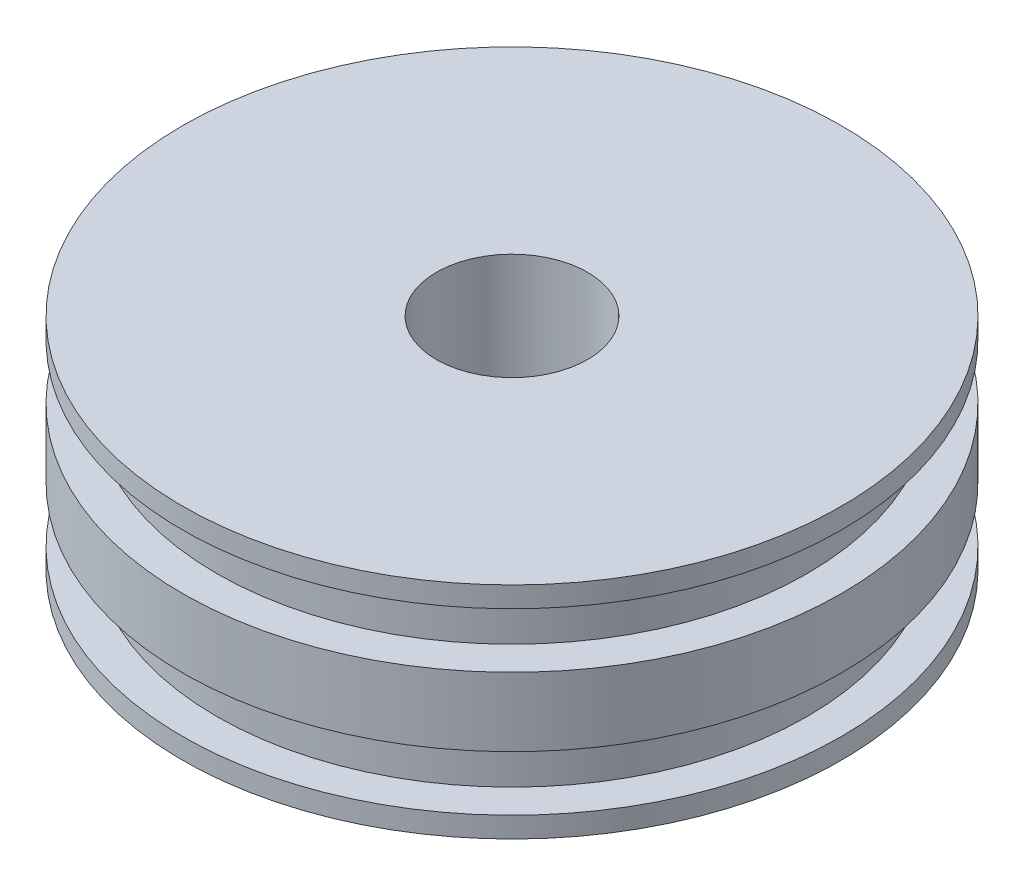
ISO-10303-21;
HEADER;
FILE_DESCRIPTION(('STEP AP214'),'2;1');
FILE_NAME('part.step','',(''),(''),'','','');
FILE_SCHEMA(('AUTOMOTIVE_DESIGN { 1 0 10303 214 1 1 1 1 }'));
ENDSEC;
DATA;
#1=APPLICATION_CONTEXT('core data for automotive mechanical design processes');
#2=APPLICATION_PROTOCOL_DEFINITION('international standard','automotive_design',2000,#1);
#3=PRODUCT_CONTEXT('',#1,'mechanical');
#4=PRODUCT('Part','Part','',(#3));
#5=PRODUCT_RELATED_PRODUCT_CATEGORY('part','',(#4));
#6=PRODUCT_DEFINITION_FORMATION('','',#4);
#7=PRODUCT_DEFINITION_CONTEXT('part definition',#1,'design');
#8=PRODUCT_DEFINITION('design','',#6,#7);
#9=PRODUCT_DEFINITION_SHAPE('','',#8);
#10=(LENGTH_UNIT() NAMED_UNIT(*) SI_UNIT(.MILLI.,.METRE.));
#11=(NAMED_UNIT(*) PLANE_ANGLE_UNIT() SI_UNIT($,.RADIAN.));
#12=(NAMED_UNIT(*) SI_UNIT($,.STERADIAN.) SOLID_ANGLE_UNIT());
#13=UNCERTAINTY_MEASURE_WITH_UNIT(LENGTH_MEASURE(1.E-05),#10,'distance_accuracy_value','');
#14=(GEOMETRIC_REPRESENTATION_CONTEXT(3) GLOBAL_UNCERTAINTY_ASSIGNED_CONTEXT((#13)) GLOBAL_UNIT_ASSIGNED_CONTEXT((#10,
#11,#12)) REPRESENTATION_CONTEXT('',''));
#15=CARTESIAN_POINT('',(0.,0.,0.));
#16=DIRECTION('',(0.,0.,1.));
#17=DIRECTION('',(1.,0.,0.));
#18=AXIS2_PLACEMENT_3D('',#15,#16,#17);
#19=CARTESIAN_POINT('',(0.,0.,0.));
#20=DIRECTION('',(0.,1.,0.));
#21=DIRECTION('',(-1.,0.,0.));
#22=AXIS2_PLACEMENT_3D('',#19,#20,#21);
#23=CYLINDRICAL_SURFACE('',#22,38.0365);
#24=CARTESIAN_POINT('',(0.,16.66875,0.));
#25=DIRECTION('',(0.,-1.,0.));
#26=DIRECTION('',(1.,0.,0.));
#27=AXIS2_PLACEMENT_3D('',#24,#25,#26);
#28=CIRCLE('',#27,38.0365);
#29=CARTESIAN_POINT('',(38.0365,16.66875,0.));
#30=VERTEX_POINT('',#29);
#31=EDGE_CURVE('E60',#30,#30,#28,.T.);
#32=ORIENTED_EDGE('',*,*,#31,.T.);
#33=EDGE_LOOP('',(#32));
#34=FACE_BOUND('',#33,.T.);
#35=CARTESIAN_POINT('',(0.,8.73124999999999,0.));
#36=DIRECTION('',(0.,-1.,0.));
#37=DIRECTION('',(1.,0.,0.));
#38=AXIS2_PLACEMENT_3D('',#35,#36,#37);
#39=CIRCLE('',#38,38.0365);
#40=CARTESIAN_POINT('',(38.0365,8.73124999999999,0.));
#41=VERTEX_POINT('',#40);
#42=EDGE_CURVE('E57',#41,#41,#39,.T.);
#43=ORIENTED_EDGE('',*,*,#42,.F.);
#44=EDGE_LOOP('',(#43));
#45=FACE_BOUND('',#44,.T.);
#46=ADVANCED_FACE('F28',(#34,#45),#23,.T.);
#47=CARTESIAN_POINT('',(0.,2.38124999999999,0.));
#48=DIRECTION('',(0.,-1.,0.));
#49=DIRECTION('',(1.,0.,0.));
#50=AXIS2_PLACEMENT_3D('',#47,#48,#49);
#51=CIRCLE('',#50,38.0365);
#52=CARTESIAN_POINT('',(38.0365,2.38124999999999,0.));
#53=VERTEX_POINT('',#52);
#54=EDGE_CURVE('E48',#53,#53,#51,.T.);
#55=ORIENTED_EDGE('',*,*,#54,.T.);
#56=EDGE_LOOP('',(#55));
#57=FACE_BOUND('',#56,.T.);
#58=CARTESIAN_POINT('',(0.,0.,0.));
#59=DIRECTION('',(0.,1.,0.));
#60=DIRECTION('',(-1.,0.,0.));
#61=AXIS2_PLACEMENT_3D('',#58,#59,#60);
#62=CIRCLE('',#61,38.0365);
#63=CARTESIAN_POINT('',(-38.0365,0.,0.));
#64=VERTEX_POINT('',#63);
#65=EDGE_CURVE('E10',#64,#64,#62,.T.);
#66=ORIENTED_EDGE('',*,*,#65,.T.);
#67=EDGE_LOOP('',(#66));
#68=FACE_BOUND('',#67,.T.);
#69=ADVANCED_FACE('F79',(#57,#68),#23,.T.);
#70=CARTESIAN_POINT('',(38.0365,25.4,0.));
#71=DIRECTION('',(0.,-1.,0.));
#72=DIRECTION('',(1.,0.,0.));
#73=AXIS2_PLACEMENT_3D('',#70,#71,#72);
#74=PLANE('',#73);
#75=CARTESIAN_POINT('',(0.,25.4,0.));
#76=DIRECTION('',(0.,1.,0.));
#77=DIRECTION('',(-1.,0.,0.));
#78=AXIS2_PLACEMENT_3D('',#75,#76,#77);
#79=CIRCLE('',#78,38.0365);
#80=CARTESIAN_POINT('',(-38.0365,25.4,0.));
#81=VERTEX_POINT('',#80);
#82=EDGE_CURVE('E35',#81,#81,#79,.T.);
#83=ORIENTED_EDGE('',*,*,#82,.T.);
#84=EDGE_LOOP('',(#83));
#85=FACE_BOUND('',#84,.T.);
#86=CARTESIAN_POINT('',(0.,25.4,0.));
#87=DIRECTION('',(0.,1.,0.));
#88=DIRECTION('',(0.,0.,1.));
#89=AXIS2_PLACEMENT_3D('',#86,#87,#88);
#90=CIRCLE('',#89,8.73124999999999);
#91=CARTESIAN_POINT('',(0.,25.4,8.73124999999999));
#92=VERTEX_POINT('',#91);
#93=EDGE_CURVE('E43',#92,#92,#90,.T.);
#94=ORIENTED_EDGE('',*,*,#93,.F.);
#95=EDGE_LOOP('',(#94));
#96=FACE_BOUND('',#95,.T.);
#97=ADVANCED_FACE('F87',(#85,#96),#74,.F.);
#98=CARTESIAN_POINT('',(0.,0.,0.));
#99=DIRECTION('',(0.,1.,0.));
#100=DIRECTION('',(-1.,0.,0.));
#101=AXIS2_PLACEMENT_3D('',#98,#99,#100);
#102=PLANE('',#101);
#103=CARTESIAN_POINT('',(0.,0.,0.));
#104=DIRECTION('',(0.,1.,0.));
#105=DIRECTION('',(-1.,0.,0.));
#106=AXIS2_PLACEMENT_3D('',#103,#104,#105);
#107=CIRCLE('',#106,8.73124999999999);
#108=CARTESIAN_POINT('',(-8.73124999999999,0.,0.));
#109=VERTEX_POINT('',#108);
#110=EDGE_CURVE('E39',#109,#109,#107,.T.);
#111=ORIENTED_EDGE('',*,*,#110,.T.);
#112=EDGE_LOOP('',(#111));
#113=FACE_BOUND('',#112,.T.);
#114=ORIENTED_EDGE('',*,*,#65,.F.);
#115=EDGE_LOOP('',(#114));
#116=FACE_BOUND('',#115,.T.);
#117=ADVANCED_FACE('F30',(#113,#116),#102,.F.);
#118=CARTESIAN_POINT('',(0.,23.01875,0.));
#119=DIRECTION('',(0.,-1.,0.));
#120=DIRECTION('',(1.,0.,0.));
#121=AXIS2_PLACEMENT_3D('',#118,#119,#120);
#122=CIRCLE('',#121,38.0365);
#123=CARTESIAN_POINT('',(38.0365,23.01875,0.));
#124=VERTEX_POINT('',#123);
#125=EDGE_CURVE('E69',#124,#124,#122,.T.);
#126=ORIENTED_EDGE('',*,*,#125,.F.);
#127=EDGE_LOOP('',(#126));
#128=FACE_BOUND('',#127,.T.);
#129=ORIENTED_EDGE('',*,*,#82,.F.);
#130=EDGE_LOOP('',(#129));
#131=FACE_BOUND('',#130,.T.);
#132=ADVANCED_FACE('F75',(#128,#131),#23,.T.);
#133=CARTESIAN_POINT('',(0.,25.4,0.));
#134=DIRECTION('',(0.,1.,0.));
#135=DIRECTION('',(0.,0.,1.));
#136=AXIS2_PLACEMENT_3D('',#133,#134,#135);
#137=CYLINDRICAL_SURFACE('',#136,8.73124999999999);
#138=ORIENTED_EDGE('',*,*,#110,.F.);
#139=EDGE_LOOP('',(#138));
#140=FACE_BOUND('',#139,.T.);
#141=ORIENTED_EDGE('',*,*,#93,.T.);
#142=EDGE_LOOP('',(#141));
#143=FACE_BOUND('',#142,.T.);
#144=ADVANCED_FACE('F78',(#140,#143),#137,.F.);
#145=CARTESIAN_POINT('',(38.0365,2.38124999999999,0.));
#146=DIRECTION('',(0.,-1.,0.));
#147=DIRECTION('',(1.,0.,0.));
#148=AXIS2_PLACEMENT_3D('',#145,#146,#147);
#149=PLANE('',#148);
#150=ORIENTED_EDGE('',*,*,#54,.F.);
#151=EDGE_LOOP('',(#150));
#152=FACE_BOUND('',#151,.T.);
#153=CARTESIAN_POINT('',(0.,2.38124999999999,0.));
#154=DIRECTION('',(0.,-1.,0.));
#155=DIRECTION('',(1.,0.,0.));
#156=AXIS2_PLACEMENT_3D('',#153,#154,#155);
#157=CIRCLE('',#156,34.06775);
#158=CARTESIAN_POINT('',(34.06775,2.38124999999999,0.));
#159=VERTEX_POINT('',#158);
#160=EDGE_CURVE('E51',#159,#159,#157,.T.);
#161=ORIENTED_EDGE('',*,*,#160,.T.);
#162=EDGE_LOOP('',(#161));
#163=FACE_BOUND('',#162,.T.);
#164=ADVANCED_FACE('F84',(#152,#163),#149,.F.);
#165=CARTESIAN_POINT('',(0.,0.,0.));
#166=DIRECTION('',(0.,-1.,0.));
#167=DIRECTION('',(1.,0.,0.));
#168=AXIS2_PLACEMENT_3D('',#165,#166,#167);
#169=CYLINDRICAL_SURFACE('',#168,34.06775);
#170=ORIENTED_EDGE('',*,*,#160,.F.);
#171=EDGE_LOOP('',(#170));
#172=FACE_BOUND('',#171,.T.);
#173=CARTESIAN_POINT('',(0.,8.73124999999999,0.));
#174=DIRECTION('',(0.,-1.,0.));
#175=DIRECTION('',(1.,0.,0.));
#176=AXIS2_PLACEMENT_3D('',#173,#174,#175);
#177=CIRCLE('',#176,34.06775);
#178=CARTESIAN_POINT('',(34.06775,8.73124999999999,0.));
#179=VERTEX_POINT('',#178);
#180=EDGE_CURVE('E54',#179,#179,#177,.T.);
#181=ORIENTED_EDGE('',*,*,#180,.T.);
#182=EDGE_LOOP('',(#181));
#183=FACE_BOUND('',#182,.T.);
#184=ADVANCED_FACE('F101',(#172,#183),#169,.T.);
#185=CARTESIAN_POINT('',(34.06775,8.73124999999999,0.));
#186=DIRECTION('',(0.,1.,0.));
#187=DIRECTION('',(-1.,0.,0.));
#188=AXIS2_PLACEMENT_3D('',#185,#186,#187);
#189=PLANE('',#188);
#190=ORIENTED_EDGE('',*,*,#180,.F.);
#191=EDGE_LOOP('',(#190));
#192=FACE_BOUND('',#191,.T.);
#193=ORIENTED_EDGE('',*,*,#42,.T.);
#194=EDGE_LOOP('',(#193));
#195=FACE_BOUND('',#194,.T.);
#196=ADVANCED_FACE('F107',(#192,#195),#189,.F.);
#197=CARTESIAN_POINT('',(38.0365,16.66875,0.));
#198=DIRECTION('',(0.,-1.,0.));
#199=DIRECTION('',(1.,0.,0.));
#200=AXIS2_PLACEMENT_3D('',#197,#198,#199);
#201=PLANE('',#200);
#202=ORIENTED_EDGE('',*,*,#31,.F.);
#203=EDGE_LOOP('',(#202));
#204=FACE_BOUND('',#203,.T.);
#205=CARTESIAN_POINT('',(0.,16.66875,0.));
#206=DIRECTION('',(0.,-1.,0.));
#207=DIRECTION('',(1.,0.,0.));
#208=AXIS2_PLACEMENT_3D('',#205,#206,#207);
#209=CIRCLE('',#208,34.06775);
#210=CARTESIAN_POINT('',(34.06775,16.66875,0.));
#211=VERTEX_POINT('',#210);
#212=EDGE_CURVE('E63',#211,#211,#209,.T.);
#213=ORIENTED_EDGE('',*,*,#212,.T.);
#214=EDGE_LOOP('',(#213));
#215=FACE_BOUND('',#214,.T.);
#216=ADVANCED_FACE('F113',(#204,#215),#201,.F.);
#217=CARTESIAN_POINT('',(0.,23.01875,0.));
#218=DIRECTION('',(0.,-1.,0.));
#219=DIRECTION('',(1.,0.,0.));
#220=AXIS2_PLACEMENT_3D('',#217,#218,#219);
#221=CYLINDRICAL_SURFACE('',#220,34.06775);
#222=ORIENTED_EDGE('',*,*,#212,.F.);
#223=EDGE_LOOP('',(#222));
#224=FACE_BOUND('',#223,.T.);
#225=CARTESIAN_POINT('',(0.,23.01875,0.));
#226=DIRECTION('',(0.,-1.,0.));
#227=DIRECTION('',(1.,0.,0.));
#228=AXIS2_PLACEMENT_3D('',#225,#226,#227);
#229=CIRCLE('',#228,34.06775);
#230=CARTESIAN_POINT('',(34.06775,23.01875,0.));
#231=VERTEX_POINT('',#230);
#232=EDGE_CURVE('E66',#231,#231,#229,.T.);
#233=ORIENTED_EDGE('',*,*,#232,.T.);
#234=EDGE_LOOP('',(#233));
#235=FACE_BOUND('',#234,.T.);
#236=ADVANCED_FACE('F120',(#224,#235),#221,.T.);
#237=CARTESIAN_POINT('',(34.06775,23.01875,0.));
#238=DIRECTION('',(0.,1.,0.));
#239=DIRECTION('',(-1.,0.,0.));
#240=AXIS2_PLACEMENT_3D('',#237,#238,#239);
#241=PLANE('',#240);
#242=ORIENTED_EDGE('',*,*,#232,.F.);
#243=EDGE_LOOP('',(#242));
#244=FACE_BOUND('',#243,.T.);
#245=ORIENTED_EDGE('',*,*,#125,.T.);
#246=EDGE_LOOP('',(#245));
#247=FACE_BOUND('',#246,.T.);
#248=ADVANCED_FACE('F73',(#244,#247),#241,.F.);
#249=CLOSED_SHELL('',(#46,#69,#97,#117,#132,#144,#164,#184,#196,#216,#236,#248));
#250=MANIFOLD_SOLID_BREP('B2',#249);
#251=ADVANCED_BREP_SHAPE_REPRESENTATION('',(#18,#250),#14);
#252=SHAPE_DEFINITION_REPRESENTATION(#9,#251);
ENDSEC;
END-ISO-10303-21;
